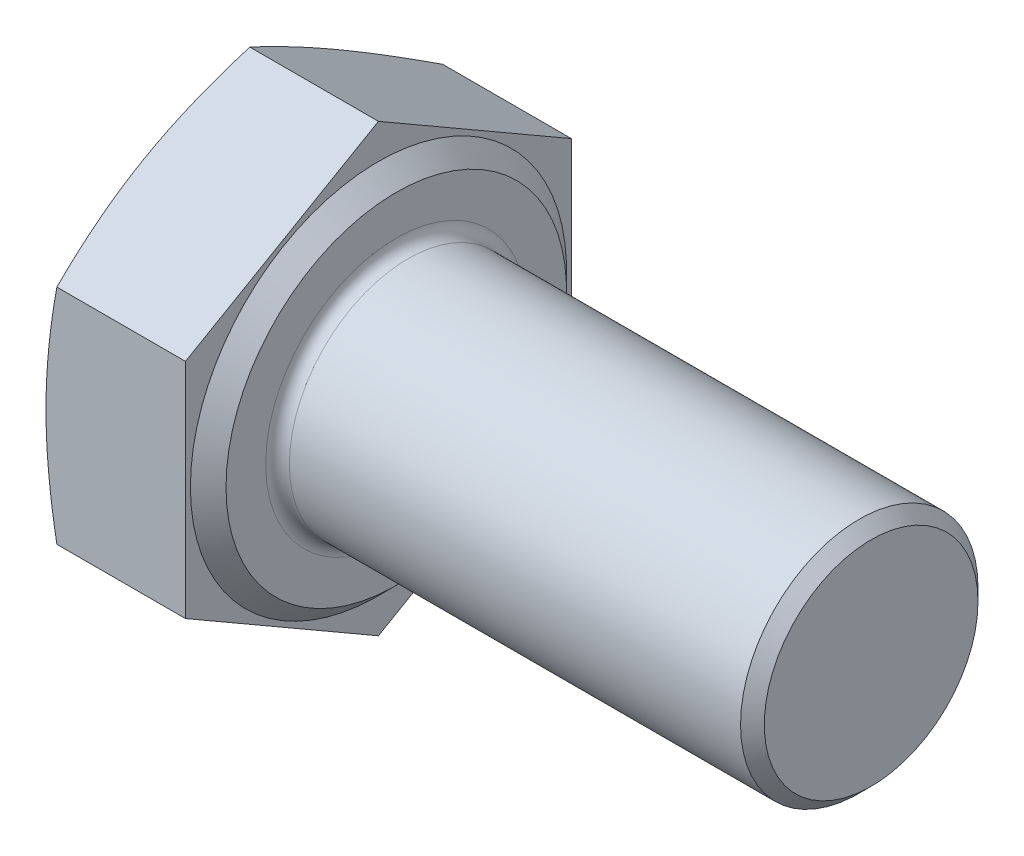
ISO-10303-21;
HEADER;
FILE_DESCRIPTION(('STEP AP214'),'2;1');
FILE_NAME('part.step','',(''),(''),'','','');
FILE_SCHEMA(('AUTOMOTIVE_DESIGN { 1 0 10303 214 1 1 1 1 }'));
ENDSEC;
DATA;
#1=APPLICATION_CONTEXT('core data for automotive mechanical design processes');
#2=APPLICATION_PROTOCOL_DEFINITION('international standard','automotive_design',2000,#1);
#3=PRODUCT_CONTEXT('',#1,'mechanical');
#4=PRODUCT('Part','Part','',(#3));
#5=PRODUCT_RELATED_PRODUCT_CATEGORY('part','',(#4));
#6=PRODUCT_DEFINITION_FORMATION('','',#4);
#7=PRODUCT_DEFINITION_CONTEXT('part definition',#1,'design');
#8=PRODUCT_DEFINITION('design','',#6,#7);
#9=PRODUCT_DEFINITION_SHAPE('','',#8);
#10=(LENGTH_UNIT() NAMED_UNIT(*) SI_UNIT(.MILLI.,.METRE.));
#11=(NAMED_UNIT(*) PLANE_ANGLE_UNIT() SI_UNIT($,.RADIAN.));
#12=(NAMED_UNIT(*) SI_UNIT($,.STERADIAN.) SOLID_ANGLE_UNIT());
#13=UNCERTAINTY_MEASURE_WITH_UNIT(LENGTH_MEASURE(1.E-05),#10,'distance_accuracy_value','');
#14=(GEOMETRIC_REPRESENTATION_CONTEXT(3) GLOBAL_UNCERTAINTY_ASSIGNED_CONTEXT((#13)) GLOBAL_UNIT_ASSIGNED_CONTEXT((#10,
#11,#12)) REPRESENTATION_CONTEXT('',''));
#15=CARTESIAN_POINT('',(0.,0.,0.));
#16=DIRECTION('',(0.,0.,1.));
#17=DIRECTION('',(1.,0.,0.));
#18=AXIS2_PLACEMENT_3D('',#15,#16,#17);
#19=CARTESIAN_POINT('',(5.3,-7.50555349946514,0.));
#20=DIRECTION('',(1.,0.,0.));
#21=DIRECTION('',(0.,0.,-1.));
#22=AXIS2_PLACEMENT_3D('',#19,#20,#21);
#23=PLANE('',#22);
#24=CARTESIAN_POINT('',(5.3,0.,0.));
#25=DIRECTION('',(1.,0.,0.));
#26=DIRECTION('',(0.,0.,-1.));
#27=AXIS2_PLACEMENT_3D('',#24,#25,#26);
#28=CIRCLE('',#27,4.4);
#29=CARTESIAN_POINT('',(5.3,0.,-4.4));
#30=VERTEX_POINT('',#29);
#31=EDGE_CURVE('E11',#30,#30,#28,.F.);
#32=ORIENTED_EDGE('',*,*,#31,.T.);
#33=EDGE_LOOP('',(#32));
#34=FACE_BOUND('',#33,.T.);
#35=CARTESIAN_POINT('',(5.3,0.,0.));
#36=DIRECTION('',(-1.,0.,0.));
#37=DIRECTION('',(0.,0.,1.));
#38=AXIS2_PLACEMENT_3D('',#35,#36,#37);
#39=CIRCLE('',#38,5.735);
#40=CARTESIAN_POINT('',(5.3,0.,5.735));
#41=VERTEX_POINT('',#40);
#42=EDGE_CURVE('E257',#41,#41,#39,.T.);
#43=ORIENTED_EDGE('',*,*,#42,.F.);
#44=EDGE_LOOP('',(#43));
#45=FACE_BOUND('',#44,.T.);
#46=ADVANCED_FACE('F32',(#34,#45),#23,.T.);
#47=CARTESIAN_POINT('',(5.3,-3.75277674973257,6.5));
#48=DIRECTION('',(0.,0.866025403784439,-0.5));
#49=DIRECTION('',(0.,0.5,0.866025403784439));
#50=AXIS2_PLACEMENT_3D('',#47,#48,#49);
#51=PLANE('',#50);
#52=CARTESIAN_POINT('',(0.36603357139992,-7.50566896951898,-0.000199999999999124));
#53=CARTESIAN_POINT('',(0.309444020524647,-7.35024872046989,0.268995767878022));
#54=CARTESIAN_POINT('',(0.257966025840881,-7.19431596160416,0.539079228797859));
#55=CARTESIAN_POINT('',(0.16739845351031,-6.88143655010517,1.08100226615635));
#56=CARTESIAN_POINT('',(0.1283185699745,-6.724489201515,1.35284304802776));
#57=CARTESIAN_POINT('',(0.0651079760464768,-6.41132237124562,1.89526390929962));
#58=CARTESIAN_POINT('',(0.0408393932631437,-6.25511004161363,2.16583160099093));
#59=CARTESIAN_POINT('',(0.00828840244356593,-5.94232007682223,2.70759971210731));
#60=CARTESIAN_POINT('',(0.,-5.78574260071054,2.97879985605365));
#61=CARTESIAN_POINT('',(0.,-5.47258764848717,3.52120014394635));
#62=CARTESIAN_POINT('',(0.00828840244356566,-5.31601017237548,3.79240028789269));
#63=CARTESIAN_POINT('',(0.0408393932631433,-5.00322020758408,4.33416839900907));
#64=CARTESIAN_POINT('',(0.0651079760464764,-4.84700787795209,4.60473609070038));
#65=CARTESIAN_POINT('',(0.128318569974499,-4.53384104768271,5.14715695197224));
#66=CARTESIAN_POINT('',(0.167398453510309,-4.37689369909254,5.41899773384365));
#67=CARTESIAN_POINT('',(0.257966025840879,-4.06401428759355,5.96092077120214));
#68=CARTESIAN_POINT('',(0.309444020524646,-3.90808152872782,6.23100423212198));
#69=CARTESIAN_POINT('',(0.366033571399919,-3.75266127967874,6.5002));
#70=B_SPLINE_CURVE_WITH_KNOTS('',3,(#52,#53,#54,#55,#56,#57,#58,#59,#60,#61,#62,#63,#64,#65,#66,
#67,#68,#69),.UNSPECIFIED.,.F.,.F.,(4,2,2,2,2,2,2,2,4),(0.,0.947946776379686,1.89663293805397,
2.83634783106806,3.77571015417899,4.71507247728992,5.65478737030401,6.6034735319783,
7.55142030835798),.UNSPECIFIED.);
#71=CARTESIAN_POINT('',(0.365991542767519,-7.50555349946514,0.));
#72=VERTEX_POINT('',#71);
#73=CARTESIAN_POINT('',(0.,-5.62916512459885,3.25));
#74=VERTEX_POINT('',#73);
#75=EDGE_CURVE('E276',#72,#74,#70,.T.);
#76=ORIENTED_EDGE('',*,*,#75,.F.);
#77=DIRECTION('',(-1.,0.,0.));
#78=VECTOR('',#77,1.);
#79=CARTESIAN_POINT('',(5.3,-7.50555349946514,0.));
#80=LINE('',#79,#78);
#81=CARTESIAN_POINT('',(4.7,-7.50555349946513,0.));
#82=VERTEX_POINT('',#81);
#83=EDGE_CURVE('E142',#82,#72,#80,.T.);
#84=ORIENTED_EDGE('',*,*,#83,.F.);
#85=DIRECTION('',(0.,-0.5,-0.866025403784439));
#86=VECTOR('',#85,1.);
#87=CARTESIAN_POINT('',(4.7,-3.75277674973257,6.5));
#88=LINE('',#87,#86);
#89=CARTESIAN_POINT('',(4.7,-3.75277674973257,6.5));
#90=VERTEX_POINT('',#89);
#91=EDGE_CURVE('E133',#90,#82,#88,.T.);
#92=ORIENTED_EDGE('',*,*,#91,.F.);
#93=DIRECTION('',(-1.,0.,0.));
#94=VECTOR('',#93,1.);
#95=CARTESIAN_POINT('',(5.3,-3.75277674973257,6.5));
#96=LINE('',#95,#94);
#97=CARTESIAN_POINT('',(0.365991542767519,-3.75277674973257,6.5));
#98=VERTEX_POINT('',#97);
#99=EDGE_CURVE('E128',#90,#98,#96,.T.);
#100=ORIENTED_EDGE('',*,*,#99,.T.);
#101=EDGE_CURVE('E121',#74,#98,#70,.T.);
#102=ORIENTED_EDGE('',*,*,#101,.F.);
#103=EDGE_LOOP('',(#76,#84,#92,#100,#102));
#104=FACE_BOUND('',#103,.T.);
#105=ADVANCED_FACE('F34',(#104),#51,.F.);
#106=CARTESIAN_POINT('',(5.3,-7.50555349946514,0.));
#107=DIRECTION('',(0.,0.866025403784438,0.5));
#108=DIRECTION('',(0.,-0.500000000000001,0.866025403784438));
#109=AXIS2_PLACEMENT_3D('',#106,#107,#108);
#110=PLANE('',#109);
#111=CARTESIAN_POINT('',(0.366033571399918,-3.75266127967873,-6.5002));
#112=CARTESIAN_POINT('',(0.309444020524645,-3.90808152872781,-6.23100423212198));
#113=CARTESIAN_POINT('',(0.257966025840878,-4.06401428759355,-5.96092077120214));
#114=CARTESIAN_POINT('',(0.167398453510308,-4.37689369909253,-5.41899773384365));
#115=CARTESIAN_POINT('',(0.128318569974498,-4.53384104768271,-5.14715695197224));
#116=CARTESIAN_POINT('',(0.0651079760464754,-4.84700787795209,-4.60473609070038));
#117=CARTESIAN_POINT('',(0.0408393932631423,-5.00322020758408,-4.33416839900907));
#118=CARTESIAN_POINT('',(0.0082884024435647,-5.31601017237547,-3.79240028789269));
#119=CARTESIAN_POINT('',(0.,-5.47258764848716,-3.52120014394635));
#120=CARTESIAN_POINT('',(0.,-5.78574260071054,-2.97879985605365));
#121=CARTESIAN_POINT('',(0.008288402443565,-5.94232007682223,-2.7075997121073));
#122=CARTESIAN_POINT('',(0.040839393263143,-6.25511004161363,-2.16583160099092));
#123=CARTESIAN_POINT('',(0.0651079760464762,-6.41132237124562,-1.89526390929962));
#124=CARTESIAN_POINT('',(0.128318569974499,-6.724489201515,-1.35284304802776));
#125=CARTESIAN_POINT('',(0.167398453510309,-6.88143655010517,-1.08100226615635));
#126=CARTESIAN_POINT('',(0.25796602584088,-7.19431596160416,-0.539079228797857));
#127=CARTESIAN_POINT('',(0.309444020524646,-7.35024872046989,-0.26899576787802));
#128=CARTESIAN_POINT('',(0.36603357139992,-7.50566896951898,0.000200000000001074));
#129=B_SPLINE_CURVE_WITH_KNOTS('',3,(#111,#112,#113,#114,#115,#116,#117,#118,#119,#120,#121,
#122,#123,#124,#125,#126,#127,#128),.UNSPECIFIED.,.F.,.F.,(4,2,2,2,2,2,2,2,4),(0.,
0.947946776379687,1.89663293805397,2.83634783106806,3.775710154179,4.71507247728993,
5.65478737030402,6.6034735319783,7.55142030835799),.UNSPECIFIED.);
#130=CARTESIAN_POINT('',(0.365991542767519,-3.75277674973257,-6.5));
#131=VERTEX_POINT('',#130);
#132=CARTESIAN_POINT('',(0.,-5.62916512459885,-3.25));
#133=VERTEX_POINT('',#132);
#134=EDGE_CURVE('E229',#131,#133,#129,.T.);
#135=ORIENTED_EDGE('',*,*,#134,.F.);
#136=DIRECTION('',(-1.,0.,0.));
#137=VECTOR('',#136,1.);
#138=CARTESIAN_POINT('',(5.3,-3.75277674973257,-6.5));
#139=LINE('',#138,#137);
#140=CARTESIAN_POINT('',(4.7,-3.75277674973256,-6.5));
#141=VERTEX_POINT('',#140);
#142=EDGE_CURVE('E139',#141,#131,#139,.T.);
#143=ORIENTED_EDGE('',*,*,#142,.F.);
#144=DIRECTION('',(0.,0.500000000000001,-0.866025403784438));
#145=VECTOR('',#144,1.);
#146=CARTESIAN_POINT('',(4.7,-7.50555349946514,0.));
#147=LINE('',#146,#145);
#148=EDGE_CURVE('E266',#82,#141,#147,.T.);
#149=ORIENTED_EDGE('',*,*,#148,.F.);
#150=ORIENTED_EDGE('',*,*,#83,.T.);
#151=EDGE_CURVE('E225',#133,#72,#129,.T.);
#152=ORIENTED_EDGE('',*,*,#151,.F.);
#153=EDGE_LOOP('',(#135,#143,#149,#150,#152));
#154=FACE_BOUND('',#153,.T.);
#155=ADVANCED_FACE('F180',(#154),#110,.F.);
#156=CARTESIAN_POINT('',(5.3,-3.75277674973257,-6.5));
#157=DIRECTION('',(0.,0.,1.));
#158=DIRECTION('',(1.,0.,0.));
#159=AXIS2_PLACEMENT_3D('',#156,#157,#158);
#160=PLANE('',#159);
#161=CARTESIAN_POINT('',(1.95571366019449,-9.93603326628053,-6.5));
#162=CARTESIAN_POINT('',(1.86616534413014,-9.64194976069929,-6.5));
#163=CARTESIAN_POINT('',(1.77766194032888,-9.34754216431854,-6.5));
#164=CARTESIAN_POINT('',(1.60332300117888,-8.757913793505,-6.5));
#165=CARTESIAN_POINT('',(1.51748767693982,-8.46269295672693,-6.5));
#166=CARTESIAN_POINT('',(1.34892015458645,-7.87076780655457,-6.5));
#167=CARTESIAN_POINT('',(1.26619404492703,-7.57406175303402,-6.5));
#168=CARTESIAN_POINT('',(1.1048134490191,-6.97954593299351,-6.5));
#169=CARTESIAN_POINT('',(1.02615888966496,-6.68173618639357,-6.5));
#170=CARTESIAN_POINT('',(0.874868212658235,-6.08849459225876,-6.5));
#171=CARTESIAN_POINT('',(0.802169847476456,-5.79307869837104,-6.5));
#172=CARTESIAN_POINT('',(0.662962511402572,-5.20077688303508,-6.5));
#173=CARTESIAN_POINT('',(0.596453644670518,-4.90389093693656,-6.5));
#174=CARTESIAN_POINT('',(0.471175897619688,-4.30858258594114,-6.5));
#175=CARTESIAN_POINT('',(0.412404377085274,-4.01016074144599,-6.5));
#176=CARTESIAN_POINT('',(0.304390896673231,-3.41158450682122,-6.5));
#177=CARTESIAN_POINT('',(0.25514861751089,-3.11143017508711,-6.5));
#178=CARTESIAN_POINT('',(0.17306978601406,-2.54318752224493,-6.5));
#179=CARTESIAN_POINT('',(0.139012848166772,-2.27527713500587,-6.5));
#180=CARTESIAN_POINT('',(0.0813625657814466,-1.738323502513,-6.5));
#181=CARTESIAN_POINT('',(0.057768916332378,-1.46928029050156,-6.5));
#182=CARTESIAN_POINT('',(0.0221814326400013,-0.930606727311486,-6.5));
#183=CARTESIAN_POINT('',(0.0101793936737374,-0.660976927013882,-6.5));
#184=CARTESIAN_POINT('',(-0.00161720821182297,-0.121447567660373,-6.5));
#185=CARTESIAN_POINT('',(-0.00141185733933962,0.148451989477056,-6.5));
#186=CARTESIAN_POINT('',(0.0112271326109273,0.689329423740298,-6.5));
#187=CARTESIAN_POINT('',(0.023722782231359,0.960305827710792,-6.5));
#188=CARTESIAN_POINT('',(0.0603673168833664,1.50146271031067,-6.5));
#189=CARTESIAN_POINT('',(0.0845164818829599,1.7716431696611,-6.5));
#190=CARTESIAN_POINT('',(0.143338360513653,2.31107475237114,-6.5));
#191=CARTESIAN_POINT('',(0.178020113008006,2.58032487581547,-6.5));
#192=CARTESIAN_POINT('',(0.256500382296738,3.11747812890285,-6.5));
#193=CARTESIAN_POINT('',(0.300298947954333,3.38538125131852,-6.5));
#194=CARTESIAN_POINT('',(0.3981077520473,3.93393829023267,-6.5));
#195=CARTESIAN_POINT('',(0.452535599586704,4.21451708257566,-6.5));
#196=CARTESIAN_POINT('',(0.568396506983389,4.77423382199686,-6.5));
#197=CARTESIAN_POINT('',(0.629830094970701,5.05337165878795,-6.5));
#198=CARTESIAN_POINT('',(0.758412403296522,5.61040543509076,-6.5));
#199=CARTESIAN_POINT('',(0.825562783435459,5.88830098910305,-6.5));
#200=CARTESIAN_POINT('',(0.964486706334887,6.4429213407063,-6.5));
#201=CARTESIAN_POINT('',(1.03626013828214,6.71964616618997,-6.5));
#202=CARTESIAN_POINT('',(1.18365887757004,7.27244360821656,-6.5));
#203=CARTESIAN_POINT('',(1.25928899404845,7.54851493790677,-6.5));
#204=CARTESIAN_POINT('',(1.41363071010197,8.09979648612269,-6.5));
#205=CARTESIAN_POINT('',(1.4923423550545,8.37500669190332,-6.5));
#206=CARTESIAN_POINT('',(1.73221572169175,9.19944068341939,-6.5));
#207=CARTESIAN_POINT('',(1.8971430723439,9.74756811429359,-6.5));
#208=CARTESIAN_POINT('',(2.2320227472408,10.8356486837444,-6.5));
#209=CARTESIAN_POINT('',(2.40189951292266,11.3756252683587,-6.5));
#210=CARTESIAN_POINT('',(2.74647925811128,12.4540616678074,-6.5));
#211=CARTESIAN_POINT('',(2.92118246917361,12.9925214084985,-6.5));
#212=CARTESIAN_POINT('',(3.27344644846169,14.0662400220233,-6.5));
#213=CARTESIAN_POINT('',(3.45099385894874,14.6015032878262,-6.5));
#214=CARTESIAN_POINT('',(3.71928531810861,15.4037138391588,-6.5));
#215=CARTESIAN_POINT('',(3.80904053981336,15.6709925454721,-6.5));
#216=CARTESIAN_POINT('',(3.98913176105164,16.2053535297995,-6.5));
#217=CARTESIAN_POINT('',(4.0794677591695,16.4724358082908,-6.5));
#218=CARTESIAN_POINT('',(4.17005521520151,16.7394327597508,-6.5));
#219=B_SPLINE_CURVE_WITH_KNOTS('',3,(#161,#162,#163,#164,#165,#166,#167,#168,#169,#170,#171,
#172,#173,#174,#175,#176,#177,#178,#179,#180,#181,#182,#183,#184,#185,#186,#187,#188,#189,#190,
#191,#192,#193,#194,#195,#196,#197,#198,#199,#200,#201,#202,#203,#204,#205,#206,#207,#208,#209,
#210,#211,#212,#213,#214,#215,#216,#217,#218),.UNSPECIFIED.,.F.,.F.,(4,2,2,2,2,2,2,2,2,2,2,2,2,
2,2,2,2,2,2,2,2,2,2,2,2,2,2,2,4),(0.,0.922251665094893,1.8445761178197,2.76862139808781,
3.69265008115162,4.60528596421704,5.51793720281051,6.43027620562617,7.34258463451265,
8.15260590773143,8.96260357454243,9.77202749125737,10.5814456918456,11.3949688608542,
12.2085115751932,13.0227544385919,13.8370016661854,14.694319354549,15.5517017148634,
16.4093338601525,17.2669454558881,18.1256539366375,18.9843750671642,20.7015057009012,
22.3996829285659,24.0979417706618,25.7897568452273,26.6355962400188,27.4814335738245),.UNSPECIFIED.);
#220=CARTESIAN_POINT('',(0.365991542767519,3.75277674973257,-6.5));
#221=VERTEX_POINT('',#220);
#222=CARTESIAN_POINT('',(0.,0.,-6.5));
#223=VERTEX_POINT('',#222);
#224=EDGE_CURVE('E292',#221,#223,#219,.F.);
#225=ORIENTED_EDGE('',*,*,#224,.F.);
#226=DIRECTION('',(-1.,0.,0.));
#227=VECTOR('',#226,1.);
#228=CARTESIAN_POINT('',(5.3,3.75277674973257,-6.5));
#229=LINE('',#228,#227);
#230=CARTESIAN_POINT('',(4.7,3.75277674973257,-6.5));
#231=VERTEX_POINT('',#230);
#232=EDGE_CURVE('E130',#231,#221,#229,.T.);
#233=ORIENTED_EDGE('',*,*,#232,.F.);
#234=DIRECTION('',(0.,1.,0.));
#235=VECTOR('',#234,1.);
#236=CARTESIAN_POINT('',(4.7,-3.75277674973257,-6.5));
#237=LINE('',#236,#235);
#238=EDGE_CURVE('E259',#141,#231,#237,.T.);
#239=ORIENTED_EDGE('',*,*,#238,.F.);
#240=ORIENTED_EDGE('',*,*,#142,.T.);
#241=EDGE_CURVE('E230',#223,#131,#219,.F.);
#242=ORIENTED_EDGE('',*,*,#241,.F.);
#243=EDGE_LOOP('',(#225,#233,#239,#240,#242));
#244=FACE_BOUND('',#243,.T.);
#245=ADVANCED_FACE('F238',(#244),#160,.F.);
#246=CARTESIAN_POINT('',(5.3,3.75277674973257,-6.5));
#247=DIRECTION('',(0.,-0.866025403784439,0.5));
#248=DIRECTION('',(0.,-0.5,-0.866025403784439));
#249=AXIS2_PLACEMENT_3D('',#246,#247,#248);
#250=PLANE('',#249);
#251=CARTESIAN_POINT('',(0.366033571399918,7.50566896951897,0.000199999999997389));
#252=CARTESIAN_POINT('',(0.309444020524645,7.35024872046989,-0.268995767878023));
#253=CARTESIAN_POINT('',(0.257966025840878,7.19431596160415,-0.539079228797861));
#254=CARTESIAN_POINT('',(0.167398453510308,6.88143655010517,-1.08100226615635));
#255=CARTESIAN_POINT('',(0.128318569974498,6.72448920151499,-1.35284304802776));
#256=CARTESIAN_POINT('',(0.0651079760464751,6.41132237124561,-1.89526390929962));
#257=CARTESIAN_POINT('',(0.0408393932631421,6.25511004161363,-2.16583160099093));
#258=CARTESIAN_POINT('',(0.00828840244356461,5.94232007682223,-2.70759971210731));
#259=CARTESIAN_POINT('',(0.,5.78574260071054,-2.97879985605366));
#260=CARTESIAN_POINT('',(0.,5.47258764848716,-3.52120014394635));
#261=CARTESIAN_POINT('',(0.00828840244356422,5.31601017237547,-3.7924002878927));
#262=CARTESIAN_POINT('',(0.0408393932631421,5.00322020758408,-4.33416839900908));
#263=CARTESIAN_POINT('',(0.0651079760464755,4.84700787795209,-4.60473609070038));
#264=CARTESIAN_POINT('',(0.128318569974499,4.53384104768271,-5.14715695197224));
#265=CARTESIAN_POINT('',(0.167398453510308,4.37689369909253,-5.41899773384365));
#266=CARTESIAN_POINT('',(0.257966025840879,4.06401428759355,-5.96092077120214));
#267=CARTESIAN_POINT('',(0.309444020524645,3.90808152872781,-6.23100423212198));
#268=CARTESIAN_POINT('',(0.366033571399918,3.75266127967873,-6.5002));
#269=B_SPLINE_CURVE_WITH_KNOTS('',3,(#251,#252,#253,#254,#255,#256,#257,#258,#259,#260,#261,
#262,#263,#264,#265,#266,#267,#268),.UNSPECIFIED.,.F.,.F.,(4,2,2,2,2,2,2,2,4),(0.,
0.947946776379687,1.89663293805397,2.83634783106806,3.77571015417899,4.71507247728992,
5.65478737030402,6.6034735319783,7.55142030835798),.UNSPECIFIED.);
#270=CARTESIAN_POINT('',(0.365991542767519,7.50555349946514,0.));
#271=VERTEX_POINT('',#270);
#272=CARTESIAN_POINT('',(0.,5.62916512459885,-3.25));
#273=VERTEX_POINT('',#272);
#274=EDGE_CURVE('E48',#271,#273,#269,.T.);
#275=ORIENTED_EDGE('',*,*,#274,.F.);
#276=DIRECTION('',(-1.,0.,0.));
#277=VECTOR('',#276,1.);
#278=CARTESIAN_POINT('',(5.3,7.50555349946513,0.));
#279=LINE('',#278,#277);
#280=CARTESIAN_POINT('',(4.7,7.50555349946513,0.));
#281=VERTEX_POINT('',#280);
#282=EDGE_CURVE('E127',#281,#271,#279,.T.);
#283=ORIENTED_EDGE('',*,*,#282,.F.);
#284=DIRECTION('',(0.,0.5,0.866025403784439));
#285=VECTOR('',#284,1.);
#286=CARTESIAN_POINT('',(4.7,3.75277674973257,-6.5));
#287=LINE('',#286,#285);
#288=EDGE_CURVE('E256',#231,#281,#287,.T.);
#289=ORIENTED_EDGE('',*,*,#288,.F.);
#290=ORIENTED_EDGE('',*,*,#232,.T.);
#291=EDGE_CURVE('E253',#273,#221,#269,.T.);
#292=ORIENTED_EDGE('',*,*,#291,.F.);
#293=EDGE_LOOP('',(#275,#283,#289,#290,#292));
#294=FACE_BOUND('',#293,.T.);
#295=ADVANCED_FACE('F242',(#294),#250,.F.);
#296=CARTESIAN_POINT('',(5.3,7.50555349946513,0.));
#297=DIRECTION('',(0.,-0.866025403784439,-0.5));
#298=DIRECTION('',(0.,0.5,-0.866025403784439));
#299=AXIS2_PLACEMENT_3D('',#296,#297,#298);
#300=PLANE('',#299);
#301=CARTESIAN_POINT('',(0.366033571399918,3.75266127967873,6.5002));
#302=CARTESIAN_POINT('',(0.309444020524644,3.90808152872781,6.23100423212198));
#303=CARTESIAN_POINT('',(0.257966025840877,4.06401428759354,5.96092077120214));
#304=CARTESIAN_POINT('',(0.167398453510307,4.37689369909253,5.41899773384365));
#305=CARTESIAN_POINT('',(0.128318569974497,4.53384104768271,5.14715695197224));
#306=CARTESIAN_POINT('',(0.0651079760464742,4.84700787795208,4.60473609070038));
#307=CARTESIAN_POINT('',(0.040839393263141,5.00322020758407,4.33416839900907));
#308=CARTESIAN_POINT('',(0.00828840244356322,5.31601017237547,3.79240028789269));
#309=CARTESIAN_POINT('',(0.,5.47258764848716,3.52120014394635));
#310=CARTESIAN_POINT('',(0.,5.78574260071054,2.97879985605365));
#311=CARTESIAN_POINT('',(0.00828840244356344,5.94232007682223,2.7075997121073));
#312=CARTESIAN_POINT('',(0.0408393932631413,6.25511004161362,2.16583160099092));
#313=CARTESIAN_POINT('',(0.0651079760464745,6.41132237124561,1.89526390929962));
#314=CARTESIAN_POINT('',(0.128318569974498,6.72448920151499,1.35284304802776));
#315=CARTESIAN_POINT('',(0.167398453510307,6.88143655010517,1.08100226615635));
#316=CARTESIAN_POINT('',(0.257966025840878,7.19431596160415,0.539079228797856));
#317=CARTESIAN_POINT('',(0.309444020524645,7.35024872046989,0.268995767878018));
#318=CARTESIAN_POINT('',(0.366033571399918,7.50566896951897,-0.000200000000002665));
#319=B_SPLINE_CURVE_WITH_KNOTS('',3,(#301,#302,#303,#304,#305,#306,#307,#308,#309,#310,#311,
#312,#313,#314,#315,#316,#317,#318),.UNSPECIFIED.,.F.,.F.,(4,2,2,2,2,2,2,2,4),(0.,
0.947946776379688,1.89663293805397,2.83634783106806,3.77571015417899,4.71507247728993,
5.65478737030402,6.6034735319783,7.55142030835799),.UNSPECIFIED.);
#320=CARTESIAN_POINT('',(0.365991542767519,3.75277674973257,6.5));
#321=VERTEX_POINT('',#320);
#322=CARTESIAN_POINT('',(0.,5.62916512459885,3.25));
#323=VERTEX_POINT('',#322);
#324=EDGE_CURVE('E56',#321,#323,#319,.T.);
#325=ORIENTED_EDGE('',*,*,#324,.F.);
#326=DIRECTION('',(-1.,0.,0.));
#327=VECTOR('',#326,1.);
#328=CARTESIAN_POINT('',(5.3,3.75277674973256,6.5));
#329=LINE('',#328,#327);
#330=CARTESIAN_POINT('',(4.7,3.75277674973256,6.5));
#331=VERTEX_POINT('',#330);
#332=EDGE_CURVE('E118',#331,#321,#329,.T.);
#333=ORIENTED_EDGE('',*,*,#332,.F.);
#334=DIRECTION('',(0.,-0.5,0.866025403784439));
#335=VECTOR('',#334,1.);
#336=CARTESIAN_POINT('',(4.7,7.50555349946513,0.));
#337=LINE('',#336,#335);
#338=EDGE_CURVE('E254',#281,#331,#337,.T.);
#339=ORIENTED_EDGE('',*,*,#338,.F.);
#340=ORIENTED_EDGE('',*,*,#282,.T.);
#341=EDGE_CURVE('E120',#323,#271,#319,.T.);
#342=ORIENTED_EDGE('',*,*,#341,.F.);
#343=EDGE_LOOP('',(#325,#333,#339,#340,#342));
#344=FACE_BOUND('',#343,.T.);
#345=ADVANCED_FACE('F116',(#344),#300,.F.);
#346=CARTESIAN_POINT('',(5.3,3.75277674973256,6.5));
#347=DIRECTION('',(0.,0.,-1.));
#348=DIRECTION('',(0.,1.,0.));
#349=AXIS2_PLACEMENT_3D('',#346,#347,#348);
#350=PLANE('',#349);
#351=CARTESIAN_POINT('',(1.9557136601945,-9.93603326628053,6.5));
#352=CARTESIAN_POINT('',(1.86616534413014,-9.6419497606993,6.5));
#353=CARTESIAN_POINT('',(1.77766194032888,-9.34754216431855,6.5));
#354=CARTESIAN_POINT('',(1.60332300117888,-8.757913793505,6.5));
#355=CARTESIAN_POINT('',(1.51748767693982,-8.46269295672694,6.5));
#356=CARTESIAN_POINT('',(1.34892015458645,-7.87076780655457,6.5));
#357=CARTESIAN_POINT('',(1.26619404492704,-7.57406175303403,6.5));
#358=CARTESIAN_POINT('',(1.1048134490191,-6.97954593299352,6.5));
#359=CARTESIAN_POINT('',(1.02615888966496,-6.68173618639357,6.5));
#360=CARTESIAN_POINT('',(0.874868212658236,-6.08849459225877,6.5));
#361=CARTESIAN_POINT('',(0.802169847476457,-5.79307869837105,6.5));
#362=CARTESIAN_POINT('',(0.662962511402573,-5.20077688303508,6.5));
#363=CARTESIAN_POINT('',(0.596453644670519,-4.90389093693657,6.5));
#364=CARTESIAN_POINT('',(0.471175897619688,-4.30858258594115,6.5));
#365=CARTESIAN_POINT('',(0.412404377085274,-4.01016074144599,6.5));
#366=CARTESIAN_POINT('',(0.304390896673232,-3.41158450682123,6.5));
#367=CARTESIAN_POINT('',(0.255148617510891,-3.11143017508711,6.5));
#368=CARTESIAN_POINT('',(0.17306978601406,-2.54318752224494,6.5));
#369=CARTESIAN_POINT('',(0.139012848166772,-2.27527713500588,6.5));
#370=CARTESIAN_POINT('',(0.0813625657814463,-1.73832350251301,6.5));
#371=CARTESIAN_POINT('',(0.0577689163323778,-1.46928029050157,6.5));
#372=CARTESIAN_POINT('',(0.0221814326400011,-0.930606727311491,6.5));
#373=CARTESIAN_POINT('',(0.0101793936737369,-0.660976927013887,6.5));
#374=CARTESIAN_POINT('',(-0.00161720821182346,-0.121447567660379,6.5));
#375=CARTESIAN_POINT('',(-0.00141185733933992,0.14845198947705,6.5));
#376=CARTESIAN_POINT('',(0.0112271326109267,0.689329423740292,6.5));
#377=CARTESIAN_POINT('',(0.0237227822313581,0.960305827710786,6.5));
#378=CARTESIAN_POINT('',(0.0603673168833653,1.50146271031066,6.5));
#379=CARTESIAN_POINT('',(0.084516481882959,1.7716431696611,6.5));
#380=CARTESIAN_POINT('',(0.143338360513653,2.31107475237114,6.5));
#381=CARTESIAN_POINT('',(0.178020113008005,2.58032487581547,6.5));
#382=CARTESIAN_POINT('',(0.256500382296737,3.11747812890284,6.5));
#383=CARTESIAN_POINT('',(0.300298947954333,3.38538125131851,6.5));
#384=CARTESIAN_POINT('',(0.398107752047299,3.93393829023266,6.5));
#385=CARTESIAN_POINT('',(0.452535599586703,4.21451708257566,6.5));
#386=CARTESIAN_POINT('',(0.568396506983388,4.77423382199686,6.5));
#387=CARTESIAN_POINT('',(0.6298300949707,5.05337165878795,6.5));
#388=CARTESIAN_POINT('',(0.758412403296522,5.61040543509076,6.5));
#389=CARTESIAN_POINT('',(0.82556278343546,5.88830098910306,6.5));
#390=CARTESIAN_POINT('',(0.964486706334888,6.4429213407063,6.5));
#391=CARTESIAN_POINT('',(1.03626013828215,6.71964616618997,6.5));
#392=CARTESIAN_POINT('',(1.18365887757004,7.27244360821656,6.5));
#393=CARTESIAN_POINT('',(1.25928899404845,7.54851493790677,6.5));
#394=CARTESIAN_POINT('',(1.41363071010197,8.09979648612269,6.5));
#395=CARTESIAN_POINT('',(1.4923423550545,8.37500669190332,6.5));
#396=CARTESIAN_POINT('',(1.73221572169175,9.1994406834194,6.5));
#397=CARTESIAN_POINT('',(1.89714307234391,9.74756811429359,6.5));
#398=CARTESIAN_POINT('',(2.2320227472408,10.8356486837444,6.5));
#399=CARTESIAN_POINT('',(2.40189951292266,11.3756252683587,6.5));
#400=CARTESIAN_POINT('',(2.74647925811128,12.4540616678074,6.5));
#401=CARTESIAN_POINT('',(2.92118246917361,12.9925214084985,6.5));
#402=CARTESIAN_POINT('',(3.27344644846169,14.0662400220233,6.5));
#403=CARTESIAN_POINT('',(3.45099385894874,14.6015032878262,6.5));
#404=CARTESIAN_POINT('',(3.71928531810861,15.4037138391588,6.5));
#405=CARTESIAN_POINT('',(3.80904053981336,15.6709925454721,6.5));
#406=CARTESIAN_POINT('',(3.98913176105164,16.2053535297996,6.5));
#407=CARTESIAN_POINT('',(4.07946775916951,16.4724358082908,6.5));
#408=CARTESIAN_POINT('',(4.17005521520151,16.7394327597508,6.5));
#409=B_SPLINE_CURVE_WITH_KNOTS('',3,(#351,#352,#353,#354,#355,#356,#357,#358,#359,#360,#361,
#362,#363,#364,#365,#366,#367,#368,#369,#370,#371,#372,#373,#374,#375,#376,#377,#378,#379,#380,
#381,#382,#383,#384,#385,#386,#387,#388,#389,#390,#391,#392,#393,#394,#395,#396,#397,#398,#399,
#400,#401,#402,#403,#404,#405,#406,#407,#408),.UNSPECIFIED.,.F.,.F.,(4,2,2,2,2,2,2,2,2,2,2,2,2,
2,2,2,2,2,2,2,2,2,2,2,2,2,2,2,4),(0.,0.922251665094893,1.84457611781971,2.76862139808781,
3.69265008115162,4.60528596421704,5.51793720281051,6.43027620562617,7.34258463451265,
8.15260590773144,8.96260357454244,9.77202749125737,10.5814456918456,11.3949688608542,
12.2085115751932,13.0227544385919,13.8370016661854,14.694319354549,15.5517017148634,
16.4093338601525,17.2669454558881,18.1256539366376,18.9843750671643,20.7015057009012,
22.3996829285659,24.0979417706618,25.7897568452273,26.6355962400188,27.4814335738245),.UNSPECIFIED.);
#410=CARTESIAN_POINT('',(0.,0.,6.5));
#411=VERTEX_POINT('',#410);
#412=EDGE_CURVE('E111',#98,#411,#409,.T.);
#413=ORIENTED_EDGE('',*,*,#412,.F.);
#414=ORIENTED_EDGE('',*,*,#99,.F.);
#415=DIRECTION('',(0.,-1.,0.));
#416=VECTOR('',#415,1.);
#417=CARTESIAN_POINT('',(4.7,3.75277674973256,6.5));
#418=LINE('',#417,#416);
#419=EDGE_CURVE('E126',#331,#90,#418,.T.);
#420=ORIENTED_EDGE('',*,*,#419,.F.);
#421=ORIENTED_EDGE('',*,*,#332,.T.);
#422=EDGE_CURVE('E103',#411,#321,#409,.T.);
#423=ORIENTED_EDGE('',*,*,#422,.F.);
#424=EDGE_LOOP('',(#413,#414,#420,#421,#423));
#425=FACE_BOUND('',#424,.T.);
#426=ADVANCED_FACE('F124',(#425),#350,.F.);
#427=CARTESIAN_POINT('',(4.7,6.33500000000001,0.));
#428=DIRECTION('',(1.,0.,0.));
#429=DIRECTION('',(0.,0.,-1.));
#430=AXIS2_PLACEMENT_3D('',#427,#428,#429);
#431=PLANE('',#430);
#432=CARTESIAN_POINT('',(4.7,0.,0.));
#433=DIRECTION('',(-1.,0.,0.));
#434=DIRECTION('',(0.,0.,1.));
#435=AXIS2_PLACEMENT_3D('',#432,#433,#434);
#436=CIRCLE('',#435,6.33500000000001);
#437=CARTESIAN_POINT('',(4.7,0.,6.33500000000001));
#438=VERTEX_POINT('',#437);
#439=EDGE_CURVE('E262',#438,#438,#436,.T.);
#440=ORIENTED_EDGE('',*,*,#439,.T.);
#441=EDGE_LOOP('',(#440));
#442=FACE_BOUND('',#441,.T.);
#443=ORIENTED_EDGE('',*,*,#91,.T.);
#444=ORIENTED_EDGE('',*,*,#148,.T.);
#445=ORIENTED_EDGE('',*,*,#238,.T.);
#446=ORIENTED_EDGE('',*,*,#288,.T.);
#447=ORIENTED_EDGE('',*,*,#338,.T.);
#448=ORIENTED_EDGE('',*,*,#419,.T.);
#449=EDGE_LOOP('',(#443,#444,#445,#446,#447,#448));
#450=FACE_BOUND('',#449,.T.);
#451=ADVANCED_FACE('F190',(#442,#450),#431,.T.);
#452=CARTESIAN_POINT('',(4.7,0.,0.));
#453=DIRECTION('',(-1.,0.,0.));
#454=DIRECTION('',(0.,0.,1.));
#455=AXIS2_PLACEMENT_3D('',#452,#453,#454);
#456=CONICAL_SURFACE('',#455,6.33500000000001,0.785398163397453);
#457=ORIENTED_EDGE('',*,*,#42,.T.);
#458=EDGE_LOOP('',(#457));
#459=FACE_BOUND('',#458,.T.);
#460=ORIENTED_EDGE('',*,*,#439,.F.);
#461=EDGE_LOOP('',(#460));
#462=FACE_BOUND('',#461,.T.);
#463=ADVANCED_FACE('F297',(#459,#462),#456,.T.);
#464=CARTESIAN_POINT('',(0.,0.,0.));
#465=DIRECTION('',(1.,0.,0.));
#466=DIRECTION('',(0.,0.,-1.));
#467=AXIS2_PLACEMENT_3D('',#464,#465,#466);
#468=CONICAL_SURFACE('',#467,6.5,1.22173047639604);
#469=ORIENTED_EDGE('',*,*,#241,.T.);
#470=ORIENTED_EDGE('',*,*,#134,.T.);
#471=CARTESIAN_POINT('',(0.,0.,0.));
#472=DIRECTION('',(1.,0.,0.));
#473=DIRECTION('',(0.,0.,-1.));
#474=AXIS2_PLACEMENT_3D('',#471,#472,#473);
#475=CIRCLE('',#474,6.5);
#476=EDGE_CURVE('E146',#133,#223,#475,.T.);
#477=ORIENTED_EDGE('',*,*,#476,.T.);
#478=EDGE_LOOP('',(#469,#470,#477));
#479=FACE_BOUND('',#478,.T.);
#480=ADVANCED_FACE('F209',(#479),#468,.T.);
#481=ORIENTED_EDGE('',*,*,#151,.T.);
#482=ORIENTED_EDGE('',*,*,#75,.T.);
#483=EDGE_CURVE('E149',#74,#133,#475,.T.);
#484=ORIENTED_EDGE('',*,*,#483,.T.);
#485=EDGE_LOOP('',(#481,#482,#484));
#486=FACE_BOUND('',#485,.T.);
#487=ADVANCED_FACE('F288',(#486),#468,.T.);
#488=ORIENTED_EDGE('',*,*,#101,.T.);
#489=ORIENTED_EDGE('',*,*,#412,.T.);
#490=EDGE_CURVE('E281',#411,#74,#475,.T.);
#491=ORIENTED_EDGE('',*,*,#490,.T.);
#492=EDGE_LOOP('',(#488,#489,#491));
#493=FACE_BOUND('',#492,.T.);
#494=ADVANCED_FACE('F280',(#493),#468,.T.);
#495=ORIENTED_EDGE('',*,*,#324,.T.);
#496=CARTESIAN_POINT('',(0.,0.,0.));
#497=DIRECTION('',(-1.,0.,0.));
#498=DIRECTION('',(0.,0.,1.));
#499=AXIS2_PLACEMENT_3D('',#496,#497,#498);
#500=CIRCLE('',#499,6.5);
#501=EDGE_CURVE('E106',#411,#323,#500,.T.);
#502=ORIENTED_EDGE('',*,*,#501,.F.);
#503=ORIENTED_EDGE('',*,*,#422,.T.);
#504=EDGE_LOOP('',(#495,#502,#503));
#505=FACE_BOUND('',#504,.T.);
#506=ADVANCED_FACE('F104',(#505),#468,.T.);
#507=ORIENTED_EDGE('',*,*,#274,.T.);
#508=EDGE_CURVE('E284',#273,#323,#475,.T.);
#509=ORIENTED_EDGE('',*,*,#508,.T.);
#510=ORIENTED_EDGE('',*,*,#341,.T.);
#511=EDGE_LOOP('',(#507,#509,#510));
#512=FACE_BOUND('',#511,.T.);
#513=ADVANCED_FACE('F207',(#512),#468,.T.);
#514=ORIENTED_EDGE('',*,*,#224,.T.);
#515=EDGE_CURVE('E150',#223,#273,#475,.T.);
#516=ORIENTED_EDGE('',*,*,#515,.T.);
#517=ORIENTED_EDGE('',*,*,#291,.T.);
#518=EDGE_LOOP('',(#514,#516,#517));
#519=FACE_BOUND('',#518,.T.);
#520=ADVANCED_FACE('F202',(#519),#468,.T.);
#521=CARTESIAN_POINT('',(0.,-7.50555349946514,0.));
#522=DIRECTION('',(1.,0.,0.));
#523=DIRECTION('',(0.,0.,-1.));
#524=AXIS2_PLACEMENT_3D('',#521,#522,#523);
#525=PLANE('',#524);
#526=ORIENTED_EDGE('',*,*,#515,.F.);
#527=ORIENTED_EDGE('',*,*,#476,.F.);
#528=ORIENTED_EDGE('',*,*,#483,.F.);
#529=ORIENTED_EDGE('',*,*,#490,.F.);
#530=ORIENTED_EDGE('',*,*,#501,.T.);
#531=ORIENTED_EDGE('',*,*,#508,.F.);
#532=EDGE_LOOP('',(#526,#527,#528,#529,#530,#531));
#533=FACE_BOUND('',#532,.T.);
#534=ADVANCED_FACE('F185',(#533),#525,.F.);
#535=CARTESIAN_POINT('',(21.3,0.,0.));
#536=DIRECTION('',(-1.,0.,0.));
#537=DIRECTION('',(0.,0.,1.));
#538=AXIS2_PLACEMENT_3D('',#535,#536,#537);
#539=CYLINDRICAL_SURFACE('',#538,4.);
#540=CARTESIAN_POINT('',(5.7,0.,0.));
#541=DIRECTION('',(1.,0.,0.));
#542=DIRECTION('',(0.,0.,-1.));
#543=AXIS2_PLACEMENT_3D('',#540,#541,#542);
#544=CIRCLE('',#543,4.);
#545=CARTESIAN_POINT('',(5.7,0.,-4.));
#546=VERTEX_POINT('',#545);
#547=EDGE_CURVE('E41',#546,#546,#544,.T.);
#548=ORIENTED_EDGE('',*,*,#547,.T.);
#549=EDGE_LOOP('',(#548));
#550=FACE_BOUND('',#549,.T.);
#551=CARTESIAN_POINT('',(20.9,0.,0.));
#552=DIRECTION('',(1.,0.,0.));
#553=DIRECTION('',(0.,0.,-1.));
#554=AXIS2_PLACEMENT_3D('',#551,#552,#553);
#555=CIRCLE('',#554,4.);
#556=CARTESIAN_POINT('',(20.9,0.,-4.));
#557=VERTEX_POINT('',#556);
#558=EDGE_CURVE('E154',#557,#557,#555,.F.);
#559=ORIENTED_EDGE('',*,*,#558,.T.);
#560=EDGE_LOOP('',(#559));
#561=FACE_BOUND('',#560,.T.);
#562=ADVANCED_FACE('F159',(#550,#561),#539,.T.);
#563=CARTESIAN_POINT('',(21.3,0.,0.));
#564=DIRECTION('',(1.,0.,0.));
#565=DIRECTION('',(0.,0.,-1.));
#566=AXIS2_PLACEMENT_3D('',#563,#564,#565);
#567=PLANE('',#566);
#568=CARTESIAN_POINT('',(21.3,0.,0.));
#569=DIRECTION('',(1.,0.,0.));
#570=DIRECTION('',(0.,0.,-1.));
#571=AXIS2_PLACEMENT_3D('',#568,#569,#570);
#572=CIRCLE('',#571,3.6);
#573=CARTESIAN_POINT('',(21.3,0.,-3.6));
#574=VERTEX_POINT('',#573);
#575=EDGE_CURVE('E151',#574,#574,#572,.T.);
#576=ORIENTED_EDGE('',*,*,#575,.T.);
#577=EDGE_LOOP('',(#576));
#578=FACE_BOUND('',#577,.T.);
#579=ADVANCED_FACE('F170',(#578),#567,.T.);
#580=CARTESIAN_POINT('',(21.3,0.,0.));
#581=DIRECTION('',(-1.,0.,0.));
#582=DIRECTION('',(0.,0.,1.));
#583=AXIS2_PLACEMENT_3D('',#580,#581,#582);
#584=CONICAL_SURFACE('',#583,3.6,0.785398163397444);
#585=ORIENTED_EDGE('',*,*,#558,.F.);
#586=EDGE_LOOP('',(#585));
#587=FACE_BOUND('',#586,.T.);
#588=ORIENTED_EDGE('',*,*,#575,.F.);
#589=EDGE_LOOP('',(#588));
#590=FACE_BOUND('',#589,.T.);
#591=ADVANCED_FACE('F164',(#587,#590),#584,.T.);
#592=CARTESIAN_POINT('',(5.7,0.,0.));
#593=DIRECTION('',(1.,0.,0.));
#594=DIRECTION('',(0.,0.,-1.));
#595=AXIS2_PLACEMENT_3D('',#592,#593,#594);
#596=TOROIDAL_SURFACE('',#595,4.4,0.4);
#597=ORIENTED_EDGE('',*,*,#31,.F.);
#598=EDGE_LOOP('',(#597));
#599=FACE_BOUND('',#598,.T.);
#600=ORIENTED_EDGE('',*,*,#547,.F.);
#601=EDGE_LOOP('',(#600));
#602=FACE_BOUND('',#601,.T.);
#603=ADVANCED_FACE('F162',(#599,#602),#596,.F.);
#604=CLOSED_SHELL('',(#46,#105,#155,#245,#295,#345,#426,#451,#463,#480,#487,#494,#506,#513,#520,
#534,#562,#579,#591,#603));
#605=MANIFOLD_SOLID_BREP('B2',#604);
#606=ADVANCED_BREP_SHAPE_REPRESENTATION('',(#18,#605),#14);
#607=SHAPE_DEFINITION_REPRESENTATION(#9,#606);
ENDSEC;
END-ISO-10303-21;
